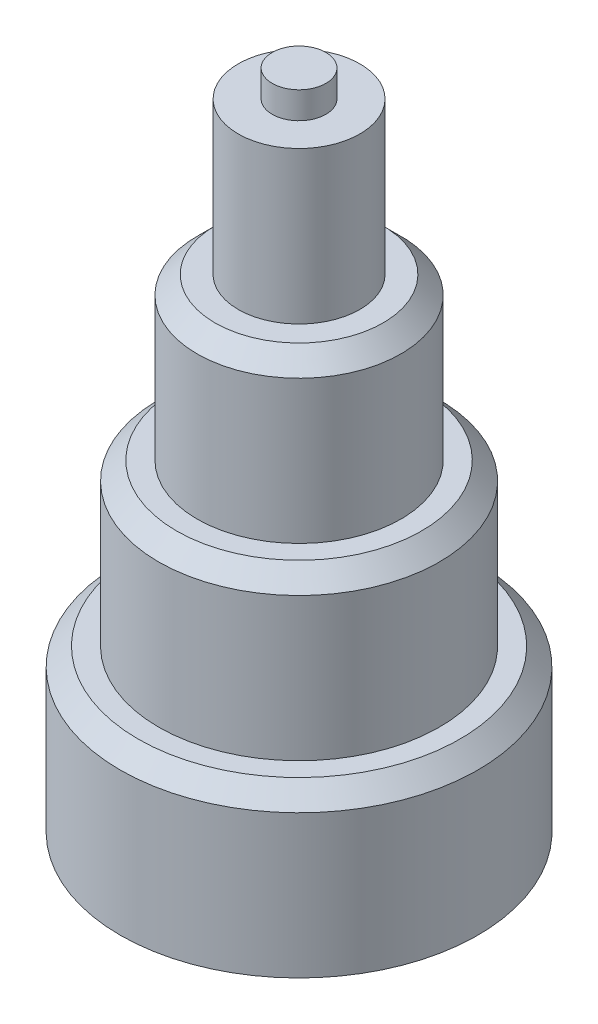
ISO-10303-21;
HEADER;
FILE_DESCRIPTION(('STEP AP214'),'2;1');
FILE_NAME('part.step','',(''),(''),'','','');
FILE_SCHEMA(('AUTOMOTIVE_DESIGN { 1 0 10303 214 1 1 1 1 }'));
ENDSEC;
DATA;
#1=APPLICATION_CONTEXT('core data for automotive mechanical design processes');
#2=APPLICATION_PROTOCOL_DEFINITION('international standard','automotive_design',2000,#1);
#3=PRODUCT_CONTEXT('',#1,'mechanical');
#4=PRODUCT('Part','Part','',(#3));
#5=PRODUCT_RELATED_PRODUCT_CATEGORY('part','',(#4));
#6=PRODUCT_DEFINITION_FORMATION('','',#4);
#7=PRODUCT_DEFINITION_CONTEXT('part definition',#1,'design');
#8=PRODUCT_DEFINITION('design','',#6,#7);
#9=PRODUCT_DEFINITION_SHAPE('','',#8);
#10=(LENGTH_UNIT() NAMED_UNIT(*) SI_UNIT(.MILLI.,.METRE.));
#11=(NAMED_UNIT(*) PLANE_ANGLE_UNIT() SI_UNIT($,.RADIAN.));
#12=(NAMED_UNIT(*) SI_UNIT($,.STERADIAN.) SOLID_ANGLE_UNIT());
#13=UNCERTAINTY_MEASURE_WITH_UNIT(LENGTH_MEASURE(1.E-05),#10,'distance_accuracy_value','');
#14=(GEOMETRIC_REPRESENTATION_CONTEXT(3) GLOBAL_UNCERTAINTY_ASSIGNED_CONTEXT((#13)) GLOBAL_UNIT_ASSIGNED_CONTEXT((#10,
#11,#12)) REPRESENTATION_CONTEXT('',''));
#15=CARTESIAN_POINT('',(0.,0.,0.));
#16=DIRECTION('',(0.,0.,1.));
#17=DIRECTION('',(1.,0.,0.));
#18=AXIS2_PLACEMENT_3D('',#15,#16,#17);
#19=CARTESIAN_POINT('',(0.,35.5,0.));
#20=DIRECTION('',(0.,1.,0.));
#21=DIRECTION('',(0.,0.,1.));
#22=AXIS2_PLACEMENT_3D('',#19,#20,#21);
#23=PLANE('',#22);
#24=CARTESIAN_POINT('',(0.,35.5,0.));
#25=DIRECTION('',(0.,1.,0.));
#26=DIRECTION('',(0.,0.,1.));
#27=AXIS2_PLACEMENT_3D('',#24,#25,#26);
#28=CIRCLE('',#27,3.4);
#29=CARTESIAN_POINT('',(0.,35.5,3.4));
#30=VERTEX_POINT('',#29);
#31=EDGE_CURVE('E67',#30,#30,#28,.T.);
#32=ORIENTED_EDGE('',*,*,#31,.T.);
#33=EDGE_LOOP('',(#32));
#34=FACE_BOUND('',#33,.T.);
#35=CARTESIAN_POINT('',(0.,35.5,0.));
#36=DIRECTION('',(0.,1.,0.));
#37=DIRECTION('',(0.,0.,1.));
#38=AXIS2_PLACEMENT_3D('',#35,#36,#37);
#39=CIRCLE('',#38,1.5);
#40=CARTESIAN_POINT('',(0.,35.5,1.5));
#41=VERTEX_POINT('',#40);
#42=EDGE_CURVE('E55',#41,#41,#39,.T.);
#43=ORIENTED_EDGE('',*,*,#42,.F.);
#44=EDGE_LOOP('',(#43));
#45=FACE_BOUND('',#44,.T.);
#46=ADVANCED_FACE('F36',(#34,#45),#23,.T.);
#47=CARTESIAN_POINT('',(0.,27.,0.));
#48=DIRECTION('',(0.,1.,0.));
#49=DIRECTION('',(0.,0.,1.));
#50=AXIS2_PLACEMENT_3D('',#47,#48,#49);
#51=PLANE('',#50);
#52=CARTESIAN_POINT('',(0.,27.,0.));
#53=DIRECTION('',(0.,1.,0.));
#54=DIRECTION('',(0.,0.,1.));
#55=AXIS2_PLACEMENT_3D('',#52,#53,#54);
#56=CIRCLE('',#55,4.69999999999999);
#57=CARTESIAN_POINT('',(0.,27.,4.69999999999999));
#58=VERTEX_POINT('',#57);
#59=EDGE_CURVE('E81',#58,#58,#56,.T.);
#60=ORIENTED_EDGE('',*,*,#59,.T.);
#61=EDGE_LOOP('',(#60));
#62=FACE_BOUND('',#61,.T.);
#63=CARTESIAN_POINT('',(0.,27.,0.));
#64=DIRECTION('',(0.,1.,0.));
#65=DIRECTION('',(0.,0.,1.));
#66=AXIS2_PLACEMENT_3D('',#63,#64,#65);
#67=CIRCLE('',#66,3.4);
#68=CARTESIAN_POINT('',(0.,27.,3.4));
#69=VERTEX_POINT('',#68);
#70=EDGE_CURVE('E65',#69,#69,#67,.T.);
#71=ORIENTED_EDGE('',*,*,#70,.F.);
#72=EDGE_LOOP('',(#71));
#73=FACE_BOUND('',#72,.T.);
#74=ADVANCED_FACE('F108',(#62,#73),#51,.T.);
#75=CARTESIAN_POINT('',(0.,18.,0.));
#76=DIRECTION('',(0.,1.,0.));
#77=DIRECTION('',(0.,0.,1.));
#78=AXIS2_PLACEMENT_3D('',#75,#76,#77);
#79=PLANE('',#78);
#80=CARTESIAN_POINT('',(0.,18.,0.));
#81=DIRECTION('',(0.,1.,0.));
#82=DIRECTION('',(0.,0.,1.));
#83=AXIS2_PLACEMENT_3D('',#80,#81,#82);
#84=CIRCLE('',#83,6.85000000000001);
#85=CARTESIAN_POINT('',(0.,18.,6.85000000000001));
#86=VERTEX_POINT('',#85);
#87=EDGE_CURVE('E87',#86,#86,#84,.T.);
#88=ORIENTED_EDGE('',*,*,#87,.T.);
#89=EDGE_LOOP('',(#88));
#90=FACE_BOUND('',#89,.T.);
#91=CARTESIAN_POINT('',(0.,18.,0.));
#92=DIRECTION('',(0.,1.,0.));
#93=DIRECTION('',(0.,0.,1.));
#94=AXIS2_PLACEMENT_3D('',#91,#92,#93);
#95=CIRCLE('',#94,5.7);
#96=CARTESIAN_POINT('',(0.,18.,5.7));
#97=VERTEX_POINT('',#96);
#98=EDGE_CURVE('E70',#97,#97,#95,.T.);
#99=ORIENTED_EDGE('',*,*,#98,.F.);
#100=EDGE_LOOP('',(#99));
#101=FACE_BOUND('',#100,.T.);
#102=ADVANCED_FACE('F114',(#90,#101),#79,.T.);
#103=CARTESIAN_POINT('',(0.,9.,0.));
#104=DIRECTION('',(0.,1.,0.));
#105=DIRECTION('',(0.,0.,1.));
#106=AXIS2_PLACEMENT_3D('',#103,#104,#105);
#107=PLANE('',#106);
#108=CARTESIAN_POINT('',(0.,9.,0.));
#109=DIRECTION('',(0.,1.,0.));
#110=DIRECTION('',(0.,0.,1.));
#111=AXIS2_PLACEMENT_3D('',#108,#109,#110);
#112=CIRCLE('',#111,9.);
#113=CARTESIAN_POINT('',(0.,9.,9.));
#114=VERTEX_POINT('',#113);
#115=EDGE_CURVE('E43',#114,#114,#112,.T.);
#116=ORIENTED_EDGE('',*,*,#115,.T.);
#117=EDGE_LOOP('',(#116));
#118=FACE_BOUND('',#117,.T.);
#119=CARTESIAN_POINT('',(0.,9.,0.));
#120=DIRECTION('',(0.,1.,0.));
#121=DIRECTION('',(0.,0.,1.));
#122=AXIS2_PLACEMENT_3D('',#119,#120,#121);
#123=CIRCLE('',#122,7.85);
#124=CARTESIAN_POINT('',(0.,9.,7.85));
#125=VERTEX_POINT('',#124);
#126=EDGE_CURVE('E75',#125,#125,#123,.T.);
#127=ORIENTED_EDGE('',*,*,#126,.F.);
#128=EDGE_LOOP('',(#127));
#129=FACE_BOUND('',#128,.T.);
#130=ADVANCED_FACE('F95',(#118,#129),#107,.T.);
#131=CARTESIAN_POINT('',(0.,9.,0.));
#132=DIRECTION('',(0.,-1.,0.));
#133=DIRECTION('',(0.,0.,-1.));
#134=AXIS2_PLACEMENT_3D('',#131,#132,#133);
#135=CYLINDRICAL_SURFACE('',#134,10.);
#136=CARTESIAN_POINT('',(0.,7.99999999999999,0.));
#137=DIRECTION('',(0.,1.,0.));
#138=DIRECTION('',(0.,0.,1.));
#139=AXIS2_PLACEMENT_3D('',#136,#137,#138);
#140=CIRCLE('',#139,10.);
#141=CARTESIAN_POINT('',(0.,7.99999999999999,10.));
#142=VERTEX_POINT('',#141);
#143=EDGE_CURVE('E11',#142,#142,#140,.F.);
#144=ORIENTED_EDGE('',*,*,#143,.T.);
#145=EDGE_LOOP('',(#144));
#146=FACE_BOUND('',#145,.T.);
#147=CARTESIAN_POINT('',(0.,0.,0.));
#148=DIRECTION('',(0.,1.,0.));
#149=DIRECTION('',(0.,0.,1.));
#150=AXIS2_PLACEMENT_3D('',#147,#148,#149);
#151=CIRCLE('',#150,10.);
#152=CARTESIAN_POINT('',(0.,0.,10.));
#153=VERTEX_POINT('',#152);
#154=EDGE_CURVE('E78',#153,#153,#151,.T.);
#155=ORIENTED_EDGE('',*,*,#154,.T.);
#156=EDGE_LOOP('',(#155));
#157=FACE_BOUND('',#156,.T.);
#158=ADVANCED_FACE('F140',(#146,#157),#135,.T.);
#159=CARTESIAN_POINT('',(0.,0.,0.));
#160=DIRECTION('',(0.,1.,0.));
#161=DIRECTION('',(0.,0.,1.));
#162=AXIS2_PLACEMENT_3D('',#159,#160,#161);
#163=PLANE('',#162);
#164=CARTESIAN_POINT('',(0.,0.,0.));
#165=DIRECTION('',(0.,-1.,0.));
#166=DIRECTION('',(0.,0.,-1.));
#167=AXIS2_PLACEMENT_3D('',#164,#165,#166);
#168=CIRCLE('',#167,2.1);
#169=CARTESIAN_POINT('',(0.,0.,-2.1));
#170=VERTEX_POINT('',#169);
#171=EDGE_CURVE('E56',#170,#170,#168,.T.);
#172=ORIENTED_EDGE('',*,*,#171,.F.);
#173=EDGE_LOOP('',(#172));
#174=FACE_BOUND('',#173,.T.);
#175=ORIENTED_EDGE('',*,*,#154,.F.);
#176=EDGE_LOOP('',(#175));
#177=FACE_BOUND('',#176,.T.);
#178=ADVANCED_FACE('F136',(#174,#177),#163,.F.);
#179=CARTESIAN_POINT('',(0.,18.,0.));
#180=DIRECTION('',(0.,-1.,0.));
#181=DIRECTION('',(0.,0.,-1.));
#182=AXIS2_PLACEMENT_3D('',#179,#180,#181);
#183=CYLINDRICAL_SURFACE('',#182,7.85);
#184=CARTESIAN_POINT('',(0.,17.,0.));
#185=DIRECTION('',(0.,1.,0.));
#186=DIRECTION('',(0.,0.,1.));
#187=AXIS2_PLACEMENT_3D('',#184,#185,#186);
#188=CIRCLE('',#187,7.85);
#189=CARTESIAN_POINT('',(0.,17.,7.85));
#190=VERTEX_POINT('',#189);
#191=EDGE_CURVE('E90',#190,#190,#188,.F.);
#192=ORIENTED_EDGE('',*,*,#191,.T.);
#193=EDGE_LOOP('',(#192));
#194=FACE_BOUND('',#193,.T.);
#195=ORIENTED_EDGE('',*,*,#126,.T.);
#196=EDGE_LOOP('',(#195));
#197=FACE_BOUND('',#196,.T.);
#198=ADVANCED_FACE('F129',(#194,#197),#183,.T.);
#199=CARTESIAN_POINT('',(0.,27.,0.));
#200=DIRECTION('',(0.,-1.,0.));
#201=DIRECTION('',(0.,0.,-1.));
#202=AXIS2_PLACEMENT_3D('',#199,#200,#201);
#203=CYLINDRICAL_SURFACE('',#202,5.7);
#204=CARTESIAN_POINT('',(0.,26.,0.));
#205=DIRECTION('',(0.,1.,0.));
#206=DIRECTION('',(0.,0.,1.));
#207=AXIS2_PLACEMENT_3D('',#204,#205,#206);
#208=CIRCLE('',#207,5.7);
#209=CARTESIAN_POINT('',(0.,26.,5.7));
#210=VERTEX_POINT('',#209);
#211=EDGE_CURVE('E84',#210,#210,#208,.F.);
#212=ORIENTED_EDGE('',*,*,#211,.T.);
#213=EDGE_LOOP('',(#212));
#214=FACE_BOUND('',#213,.T.);
#215=ORIENTED_EDGE('',*,*,#98,.T.);
#216=EDGE_LOOP('',(#215));
#217=FACE_BOUND('',#216,.T.);
#218=ADVANCED_FACE('F124',(#214,#217),#203,.T.);
#219=CARTESIAN_POINT('',(0.,35.5,0.));
#220=DIRECTION('',(0.,-1.,0.));
#221=DIRECTION('',(0.,0.,-1.));
#222=AXIS2_PLACEMENT_3D('',#219,#220,#221);
#223=CYLINDRICAL_SURFACE('',#222,3.4);
#224=ORIENTED_EDGE('',*,*,#31,.F.);
#225=EDGE_LOOP('',(#224));
#226=FACE_BOUND('',#225,.T.);
#227=ORIENTED_EDGE('',*,*,#70,.T.);
#228=EDGE_LOOP('',(#227));
#229=FACE_BOUND('',#228,.T.);
#230=ADVANCED_FACE('F122',(#226,#229),#223,.T.);
#231=CARTESIAN_POINT('',(0.,37.,0.));
#232=DIRECTION('',(0.,-1.,0.));
#233=DIRECTION('',(0.,0.,-1.));
#234=AXIS2_PLACEMENT_3D('',#231,#232,#233);
#235=CYLINDRICAL_SURFACE('',#234,1.5);
#236=CARTESIAN_POINT('',(0.,37.,0.));
#237=DIRECTION('',(0.,1.,0.));
#238=DIRECTION('',(0.,0.,1.));
#239=AXIS2_PLACEMENT_3D('',#236,#237,#238);
#240=CIRCLE('',#239,1.5);
#241=CARTESIAN_POINT('',(0.,37.,1.5));
#242=VERTEX_POINT('',#241);
#243=EDGE_CURVE('E59',#242,#242,#240,.T.);
#244=ORIENTED_EDGE('',*,*,#243,.F.);
#245=EDGE_LOOP('',(#244));
#246=FACE_BOUND('',#245,.T.);
#247=ORIENTED_EDGE('',*,*,#42,.T.);
#248=EDGE_LOOP('',(#247));
#249=FACE_BOUND('',#248,.T.);
#250=ADVANCED_FACE('F120',(#246,#249),#235,.T.);
#251=CARTESIAN_POINT('',(0.,37.,0.));
#252=DIRECTION('',(0.,1.,0.));
#253=DIRECTION('',(0.,0.,1.));
#254=AXIS2_PLACEMENT_3D('',#251,#252,#253);
#255=PLANE('',#254);
#256=ORIENTED_EDGE('',*,*,#243,.T.);
#257=EDGE_LOOP('',(#256));
#258=FACE_BOUND('',#257,.T.);
#259=ADVANCED_FACE('F148',(#258),#255,.T.);
#260=CARTESIAN_POINT('',(0.,27.,0.));
#261=DIRECTION('',(0.,-1.,0.));
#262=DIRECTION('',(0.,0.,-1.));
#263=AXIS2_PLACEMENT_3D('',#260,#261,#262);
#264=CONICAL_SURFACE('',#263,4.69999999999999,0.785398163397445);
#265=ORIENTED_EDGE('',*,*,#211,.F.);
#266=EDGE_LOOP('',(#265));
#267=FACE_BOUND('',#266,.T.);
#268=ORIENTED_EDGE('',*,*,#59,.F.);
#269=EDGE_LOOP('',(#268));
#270=FACE_BOUND('',#269,.T.);
#271=ADVANCED_FACE('F104',(#267,#270),#264,.T.);
#272=CARTESIAN_POINT('',(0.,18.,0.));
#273=DIRECTION('',(0.,-1.,0.));
#274=DIRECTION('',(0.,0.,-1.));
#275=AXIS2_PLACEMENT_3D('',#272,#273,#274);
#276=CONICAL_SURFACE('',#275,6.85000000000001,0.785398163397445);
#277=ORIENTED_EDGE('',*,*,#191,.F.);
#278=EDGE_LOOP('',(#277));
#279=FACE_BOUND('',#278,.T.);
#280=ORIENTED_EDGE('',*,*,#87,.F.);
#281=EDGE_LOOP('',(#280));
#282=FACE_BOUND('',#281,.T.);
#283=ADVANCED_FACE('F99',(#279,#282),#276,.T.);
#284=CARTESIAN_POINT('',(0.,9.,0.));
#285=DIRECTION('',(0.,-1.,0.));
#286=DIRECTION('',(0.,0.,-1.));
#287=AXIS2_PLACEMENT_3D('',#284,#285,#286);
#288=CONICAL_SURFACE('',#287,9.,0.785398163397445);
#289=ORIENTED_EDGE('',*,*,#143,.F.);
#290=EDGE_LOOP('',(#289));
#291=FACE_BOUND('',#290,.T.);
#292=ORIENTED_EDGE('',*,*,#115,.F.);
#293=EDGE_LOOP('',(#292));
#294=FACE_BOUND('',#293,.T.);
#295=ADVANCED_FACE('F38',(#291,#294),#288,.T.);
#296=CARTESIAN_POINT('',(0.,17.4,0.));
#297=DIRECTION('',(0.,-1.,0.));
#298=DIRECTION('',(0.,0.,-1.));
#299=AXIS2_PLACEMENT_3D('',#296,#297,#298);
#300=CONICAL_SURFACE('',#299,2.1,1.02974425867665);
#301=CARTESIAN_POINT('',(0.,18.6618072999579,0.));
#302=VERTEX_POINT('',#301);
#303=VERTEX_LOOP('',#302);
#304=FACE_BOUND('',#303,.T.);
#305=CARTESIAN_POINT('',(0.,17.4,0.));
#306=DIRECTION('',(0.,-1.,0.));
#307=DIRECTION('',(0.,0.,-1.));
#308=AXIS2_PLACEMENT_3D('',#305,#306,#307);
#309=CIRCLE('',#308,2.1);
#310=CARTESIAN_POINT('',(0.,17.4,-2.1));
#311=VERTEX_POINT('',#310);
#312=EDGE_CURVE('E53',#311,#311,#309,.T.);
#313=ORIENTED_EDGE('',*,*,#312,.T.);
#314=EDGE_LOOP('',(#313));
#315=FACE_BOUND('',#314,.T.);
#316=ADVANCED_FACE('F46',(#304,#315),#300,.F.);
#317=CARTESIAN_POINT('',(0.,0.,0.));
#318=DIRECTION('',(0.,-1.,0.));
#319=DIRECTION('',(0.,0.,-1.));
#320=AXIS2_PLACEMENT_3D('',#317,#318,#319);
#321=CYLINDRICAL_SURFACE('',#320,2.1);
#322=ORIENTED_EDGE('',*,*,#312,.F.);
#323=EDGE_LOOP('',(#322));
#324=FACE_BOUND('',#323,.T.);
#325=ORIENTED_EDGE('',*,*,#171,.T.);
#326=EDGE_LOOP('',(#325));
#327=FACE_BOUND('',#326,.T.);
#328=ADVANCED_FACE('F49',(#324,#327),#321,.F.);
#329=CLOSED_SHELL('',(#46,#74,#102,#130,#158,#178,#198,#218,#230,#250,#259,#271,#283,#295,#316,#328));
#330=MANIFOLD_SOLID_BREP('B2',#329);
#331=ADVANCED_BREP_SHAPE_REPRESENTATION('',(#18,#330),#14);
#332=SHAPE_DEFINITION_REPRESENTATION(#9,#331);
ENDSEC;
END-ISO-10303-21;
